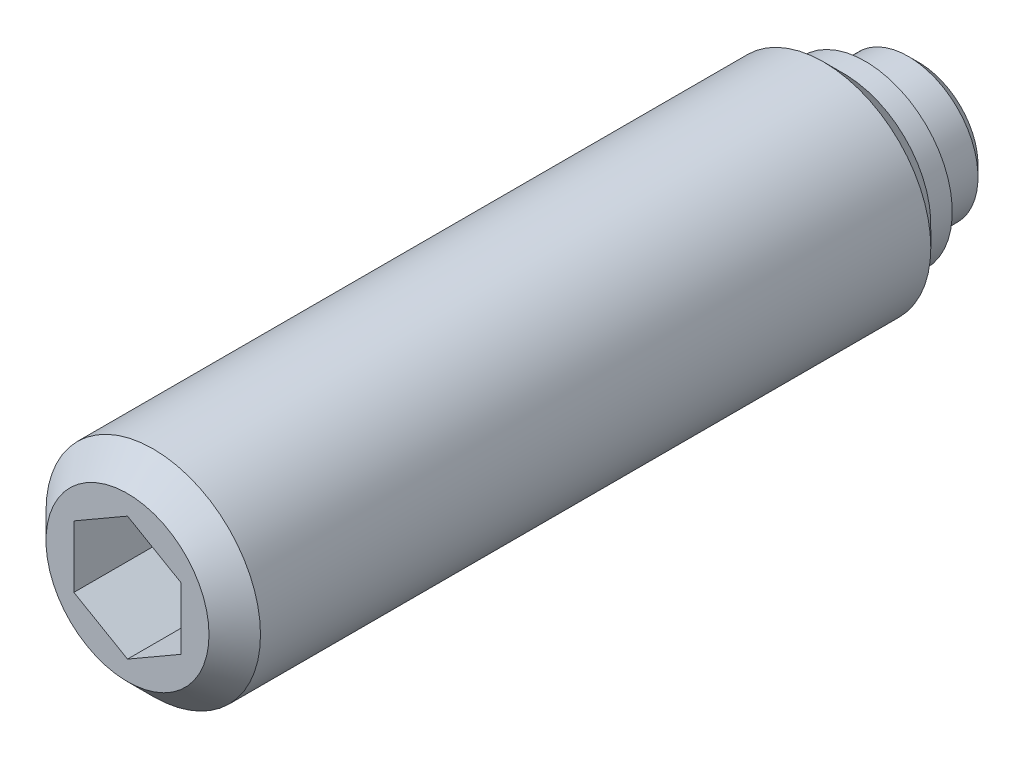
ISO-10303-21;
HEADER;
FILE_DESCRIPTION(('STEP AP214'),'2;1');
FILE_NAME('part.step','',(''),(''),'','','');
FILE_SCHEMA(('AUTOMOTIVE_DESIGN { 1 0 10303 214 1 1 1 1 }'));
ENDSEC;
DATA;
#1=APPLICATION_CONTEXT('core data for automotive mechanical design processes');
#2=APPLICATION_PROTOCOL_DEFINITION('international standard','automotive_design',2000,#1);
#3=PRODUCT_CONTEXT('',#1,'mechanical');
#4=PRODUCT('Part','Part','',(#3));
#5=PRODUCT_RELATED_PRODUCT_CATEGORY('part','',(#4));
#6=PRODUCT_DEFINITION_FORMATION('','',#4);
#7=PRODUCT_DEFINITION_CONTEXT('part definition',#1,'design');
#8=PRODUCT_DEFINITION('design','',#6,#7);
#9=PRODUCT_DEFINITION_SHAPE('','',#8);
#10=(LENGTH_UNIT() NAMED_UNIT(*) SI_UNIT(.MILLI.,.METRE.));
#11=(NAMED_UNIT(*) PLANE_ANGLE_UNIT() SI_UNIT($,.RADIAN.));
#12=(NAMED_UNIT(*) SI_UNIT($,.STERADIAN.) SOLID_ANGLE_UNIT());
#13=UNCERTAINTY_MEASURE_WITH_UNIT(LENGTH_MEASURE(1.E-05),#10,'distance_accuracy_value','');
#14=(GEOMETRIC_REPRESENTATION_CONTEXT(3) GLOBAL_UNCERTAINTY_ASSIGNED_CONTEXT((#13)) GLOBAL_UNIT_ASSIGNED_CONTEXT((#10,
#11,#12)) REPRESENTATION_CONTEXT('',''));
#15=CARTESIAN_POINT('',(0.,0.,0.));
#16=DIRECTION('',(0.,0.,1.));
#17=DIRECTION('',(1.,0.,0.));
#18=AXIS2_PLACEMENT_3D('',#15,#16,#17);
#19=CARTESIAN_POINT('',(0.,0.,2.5));
#20=DIRECTION('',(0.,0.,-1.));
#21=DIRECTION('',(-1.,0.,0.));
#22=AXIS2_PLACEMENT_3D('',#19,#20,#21);
#23=CYLINDRICAL_SURFACE('',#22,5.);
#24=CARTESIAN_POINT('',(0.,0.,35.7));
#25=DIRECTION('',(0.,0.,1.));
#26=DIRECTION('',(1.,0.,0.));
#27=AXIS2_PLACEMENT_3D('',#24,#25,#26);
#28=CIRCLE('',#27,5.);
#29=CARTESIAN_POINT('',(5.,0.,35.7));
#30=VERTEX_POINT('',#29);
#31=EDGE_CURVE('E9',#30,#30,#28,.F.);
#32=ORIENTED_EDGE('',*,*,#31,.T.);
#33=EDGE_LOOP('',(#32));
#34=FACE_BOUND('',#33,.T.);
#35=CARTESIAN_POINT('',(0.,0.,4.45));
#36=DIRECTION('',(0.,0.,-1.));
#37=DIRECTION('',(-1.,0.,0.));
#38=AXIS2_PLACEMENT_3D('',#35,#36,#37);
#39=CIRCLE('',#38,5.);
#40=CARTESIAN_POINT('',(-5.,0.,4.45));
#41=VERTEX_POINT('',#40);
#42=EDGE_CURVE('E74',#41,#41,#39,.T.);
#43=ORIENTED_EDGE('',*,*,#42,.F.);
#44=EDGE_LOOP('',(#43));
#45=FACE_BOUND('',#44,.T.);
#46=ADVANCED_FACE('F14',(#34,#45),#23,.T.);
#47=CARTESIAN_POINT('',(0.,0.,0.));
#48=DIRECTION('',(0.,0.,-1.));
#49=DIRECTION('',(-1.,0.,0.));
#50=AXIS2_PLACEMENT_3D('',#47,#48,#49);
#51=CYLINDRICAL_SURFACE('',#50,3.25);
#52=CARTESIAN_POINT('',(0.,0.,0.5));
#53=DIRECTION('',(0.,0.,-1.));
#54=DIRECTION('',(-1.,0.,0.));
#55=AXIS2_PLACEMENT_3D('',#52,#53,#54);
#56=CIRCLE('',#55,3.25);
#57=CARTESIAN_POINT('',(-3.25,0.,0.5));
#58=VERTEX_POINT('',#57);
#59=EDGE_CURVE('E106',#58,#58,#56,.T.);
#60=ORIENTED_EDGE('',*,*,#59,.F.);
#61=EDGE_LOOP('',(#60));
#62=FACE_BOUND('',#61,.T.);
#63=CARTESIAN_POINT('',(0.,0.,2.5));
#64=DIRECTION('',(0.,0.,-1.));
#65=DIRECTION('',(-1.,0.,0.));
#66=AXIS2_PLACEMENT_3D('',#63,#64,#65);
#67=CIRCLE('',#66,3.25);
#68=CARTESIAN_POINT('',(-3.25,0.,2.5));
#69=VERTEX_POINT('',#68);
#70=EDGE_CURVE('E100',#69,#69,#67,.T.);
#71=ORIENTED_EDGE('',*,*,#70,.T.);
#72=EDGE_LOOP('',(#71));
#73=FACE_BOUND('',#72,.T.);
#74=ADVANCED_FACE('F130',(#62,#73),#51,.T.);
#75=CARTESIAN_POINT('',(0.,0.,0.5));
#76=DIRECTION('',(0.,0.,1.));
#77=DIRECTION('',(1.,0.,0.));
#78=AXIS2_PLACEMENT_3D('',#75,#76,#77);
#79=CONICAL_SURFACE('',#78,3.25,0.785398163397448);
#80=CARTESIAN_POINT('',(0.,0.,0.));
#81=DIRECTION('',(0.,0.,-1.));
#82=DIRECTION('',(-1.,0.,0.));
#83=AXIS2_PLACEMENT_3D('',#80,#81,#82);
#84=CIRCLE('',#83,2.75);
#85=CARTESIAN_POINT('',(-2.75,0.,0.));
#86=VERTEX_POINT('',#85);
#87=EDGE_CURVE('E103',#86,#86,#84,.T.);
#88=ORIENTED_EDGE('',*,*,#87,.F.);
#89=EDGE_LOOP('',(#88));
#90=FACE_BOUND('',#89,.T.);
#91=ORIENTED_EDGE('',*,*,#59,.T.);
#92=EDGE_LOOP('',(#91));
#93=FACE_BOUND('',#92,.T.);
#94=ADVANCED_FACE('F135',(#90,#93),#79,.T.);
#95=CARTESIAN_POINT('',(0.,2.75,0.));
#96=DIRECTION('',(0.,0.,1.));
#97=DIRECTION('',(1.,0.,0.));
#98=AXIS2_PLACEMENT_3D('',#95,#96,#97);
#99=PLANE('',#98);
#100=ORIENTED_EDGE('',*,*,#87,.T.);
#101=EDGE_LOOP('',(#100));
#102=FACE_BOUND('',#101,.T.);
#103=ADVANCED_FACE('F150',(#102),#99,.F.);
#104=CARTESIAN_POINT('',(0.,4.05,2.5));
#105=DIRECTION('',(0.,0.,1.));
#106=DIRECTION('',(1.,0.,0.));
#107=AXIS2_PLACEMENT_3D('',#104,#105,#106);
#108=PLANE('',#107);
#109=CARTESIAN_POINT('',(0.,0.,2.5));
#110=DIRECTION('',(0.,0.,-1.));
#111=DIRECTION('',(-1.,0.,0.));
#112=AXIS2_PLACEMENT_3D('',#109,#110,#111);
#113=CIRCLE('',#112,4.05);
#114=CARTESIAN_POINT('',(-4.05,0.,2.5));
#115=VERTEX_POINT('',#114);
#116=EDGE_CURVE('E109',#115,#115,#113,.T.);
#117=ORIENTED_EDGE('',*,*,#116,.T.);
#118=EDGE_LOOP('',(#117));
#119=FACE_BOUND('',#118,.T.);
#120=ORIENTED_EDGE('',*,*,#70,.F.);
#121=EDGE_LOOP('',(#120));
#122=FACE_BOUND('',#121,.T.);
#123=ADVANCED_FACE('F147',(#119,#122),#108,.F.);
#124=CARTESIAN_POINT('',(0.,0.,2.5));
#125=DIRECTION('',(0.,0.,-1.));
#126=DIRECTION('',(-1.,0.,0.));
#127=AXIS2_PLACEMENT_3D('',#124,#125,#126);
#128=CYLINDRICAL_SURFACE('',#127,4.05);
#129=CARTESIAN_POINT('',(0.,0.,3.5));
#130=DIRECTION('',(0.,0.,-1.));
#131=DIRECTION('',(-1.,0.,0.));
#132=AXIS2_PLACEMENT_3D('',#129,#130,#131);
#133=CIRCLE('',#132,4.05);
#134=CARTESIAN_POINT('',(-4.05,0.,3.5));
#135=VERTEX_POINT('',#134);
#136=EDGE_CURVE('E112',#135,#135,#133,.T.);
#137=ORIENTED_EDGE('',*,*,#136,.T.);
#138=EDGE_LOOP('',(#137));
#139=FACE_BOUND('',#138,.T.);
#140=ORIENTED_EDGE('',*,*,#116,.F.);
#141=EDGE_LOOP('',(#140));
#142=FACE_BOUND('',#141,.T.);
#143=ADVANCED_FACE('F143',(#139,#142),#128,.T.);
#144=CARTESIAN_POINT('',(0.,0.,4.45));
#145=DIRECTION('',(0.,0.,1.));
#146=DIRECTION('',(1.,0.,0.));
#147=AXIS2_PLACEMENT_3D('',#144,#145,#146);
#148=CONICAL_SURFACE('',#147,5.,0.785398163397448);
#149=ORIENTED_EDGE('',*,*,#42,.T.);
#150=EDGE_LOOP('',(#149));
#151=FACE_BOUND('',#150,.T.);
#152=ORIENTED_EDGE('',*,*,#136,.F.);
#153=EDGE_LOOP('',(#152));
#154=FACE_BOUND('',#153,.T.);
#155=ADVANCED_FACE('F140',(#151,#154),#148,.T.);
#156=CARTESIAN_POINT('',(0.,0.,36.9));
#157=DIRECTION('',(0.,0.,1.));
#158=DIRECTION('',(1.,0.,0.));
#159=AXIS2_PLACEMENT_3D('',#156,#157,#158);
#160=PLANE('',#159);
#161=CARTESIAN_POINT('',(0.,0.,36.9));
#162=DIRECTION('',(0.,0.,1.));
#163=DIRECTION('',(1.,0.,0.));
#164=AXIS2_PLACEMENT_3D('',#161,#162,#163);
#165=CIRCLE('',#164,3.8);
#166=CARTESIAN_POINT('',(3.8,0.,36.9));
#167=VERTEX_POINT('',#166);
#168=EDGE_CURVE('E22',#167,#167,#165,.T.);
#169=ORIENTED_EDGE('',*,*,#168,.T.);
#170=EDGE_LOOP('',(#169));
#171=FACE_BOUND('',#170,.T.);
#172=DIRECTION('',(-0.866025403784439,0.5,0.));
#173=VECTOR('',#172,1.);
#174=CARTESIAN_POINT('',(-2.5,-1.44337567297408,36.9));
#175=LINE('',#174,#173);
#176=CARTESIAN_POINT('',(0.,-2.88675134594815,36.9));
#177=VERTEX_POINT('',#176);
#178=CARTESIAN_POINT('',(-2.5,-1.44337567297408,36.9));
#179=VERTEX_POINT('',#178);
#180=EDGE_CURVE('E69',#177,#179,#175,.T.);
#181=ORIENTED_EDGE('',*,*,#180,.T.);
#182=DIRECTION('',(0.,1.,0.));
#183=VECTOR('',#182,1.);
#184=CARTESIAN_POINT('',(-2.5,1.44337567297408,36.9));
#185=LINE('',#184,#183);
#186=CARTESIAN_POINT('',(-2.5,1.44337567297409,36.9));
#187=VERTEX_POINT('',#186);
#188=EDGE_CURVE('E84',#179,#187,#185,.T.);
#189=ORIENTED_EDGE('',*,*,#188,.T.);
#190=DIRECTION('',(0.866025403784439,0.5,0.));
#191=VECTOR('',#190,1.);
#192=CARTESIAN_POINT('',(0.,2.88675134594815,36.9));
#193=LINE('',#192,#191);
#194=CARTESIAN_POINT('',(0.,2.88675134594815,36.9));
#195=VERTEX_POINT('',#194);
#196=EDGE_CURVE('E301',#187,#195,#193,.T.);
#197=ORIENTED_EDGE('',*,*,#196,.T.);
#198=DIRECTION('',(0.866025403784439,-0.5,0.));
#199=VECTOR('',#198,1.);
#200=CARTESIAN_POINT('',(2.5,1.44337567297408,36.9));
#201=LINE('',#200,#199);
#202=CARTESIAN_POINT('',(2.5,1.44337567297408,36.9));
#203=VERTEX_POINT('',#202);
#204=EDGE_CURVE('E298',#195,#203,#201,.T.);
#205=ORIENTED_EDGE('',*,*,#204,.T.);
#206=DIRECTION('',(0.,-1.,0.));
#207=VECTOR('',#206,1.);
#208=CARTESIAN_POINT('',(2.5,-1.44337567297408,36.9));
#209=LINE('',#208,#207);
#210=CARTESIAN_POINT('',(2.5,-1.44337567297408,36.9));
#211=VERTEX_POINT('',#210);
#212=EDGE_CURVE('E29',#203,#211,#209,.T.);
#213=ORIENTED_EDGE('',*,*,#212,.T.);
#214=DIRECTION('',(-0.866025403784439,-0.5,0.));
#215=VECTOR('',#214,1.);
#216=CARTESIAN_POINT('',(0.,-2.88675134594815,36.9));
#217=LINE('',#216,#215);
#218=EDGE_CURVE('E66',#211,#177,#217,.T.);
#219=ORIENTED_EDGE('',*,*,#218,.T.);
#220=EDGE_LOOP('',(#181,#189,#197,#205,#213,#219));
#221=FACE_BOUND('',#220,.T.);
#222=ADVANCED_FACE('F68',(#171,#221),#160,.T.);
#223=CARTESIAN_POINT('',(0.,0.,30.9));
#224=DIRECTION('',(0.,0.,1.));
#225=DIRECTION('',(1.,0.,0.));
#226=AXIS2_PLACEMENT_3D('',#223,#224,#225);
#227=PLANE('',#226);
#228=DIRECTION('',(0.,-1.,0.));
#229=VECTOR('',#228,1.);
#230=CARTESIAN_POINT('',(-2.5,1.44337567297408,30.9));
#231=LINE('',#230,#229);
#232=CARTESIAN_POINT('',(-2.5,1.44337567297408,30.9));
#233=VERTEX_POINT('',#232);
#234=CARTESIAN_POINT('',(-2.5,-1.44337567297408,30.9));
#235=VERTEX_POINT('',#234);
#236=EDGE_CURVE('E83',#233,#235,#231,.T.);
#237=ORIENTED_EDGE('',*,*,#236,.T.);
#238=DIRECTION('',(0.866025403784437,-0.5,0.));
#239=VECTOR('',#238,1.);
#240=CARTESIAN_POINT('',(-2.5,-1.44337567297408,30.9));
#241=LINE('',#240,#239);
#242=CARTESIAN_POINT('',(0.,-2.88675134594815,30.9));
#243=VERTEX_POINT('',#242);
#244=EDGE_CURVE('E280',#235,#243,#241,.T.);
#245=ORIENTED_EDGE('',*,*,#244,.T.);
#246=DIRECTION('',(0.866025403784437,0.5,0.));
#247=VECTOR('',#246,1.);
#248=CARTESIAN_POINT('',(0.,-2.88675134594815,30.9));
#249=LINE('',#248,#247);
#250=CARTESIAN_POINT('',(2.5,-1.44337567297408,30.9));
#251=VERTEX_POINT('',#250);
#252=EDGE_CURVE('E88',#243,#251,#249,.T.);
#253=ORIENTED_EDGE('',*,*,#252,.T.);
#254=DIRECTION('',(0.,1.,0.));
#255=VECTOR('',#254,1.);
#256=CARTESIAN_POINT('',(2.5,-1.44337567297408,30.9));
#257=LINE('',#256,#255);
#258=CARTESIAN_POINT('',(2.5,1.44337567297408,30.9));
#259=VERTEX_POINT('',#258);
#260=EDGE_CURVE('E287',#251,#259,#257,.T.);
#261=ORIENTED_EDGE('',*,*,#260,.T.);
#262=DIRECTION('',(-0.866025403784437,0.5,0.));
#263=VECTOR('',#262,1.);
#264=CARTESIAN_POINT('',(2.5,1.44337567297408,30.9));
#265=LINE('',#264,#263);
#266=CARTESIAN_POINT('',(0.,2.88675134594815,30.9));
#267=VERTEX_POINT('',#266);
#268=EDGE_CURVE('E96',#259,#267,#265,.T.);
#269=ORIENTED_EDGE('',*,*,#268,.T.);
#270=DIRECTION('',(-0.866025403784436,-0.5,0.));
#271=VECTOR('',#270,1.);
#272=CARTESIAN_POINT('',(0.,2.88675134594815,30.9));
#273=LINE('',#272,#271);
#274=EDGE_CURVE('E91',#267,#233,#273,.T.);
#275=ORIENTED_EDGE('',*,*,#274,.T.);
#276=EDGE_LOOP('',(#237,#245,#253,#261,#269,#275));
#277=FACE_BOUND('',#276,.T.);
#278=ADVANCED_FACE('F162',(#277),#227,.T.);
#279=CARTESIAN_POINT('',(0.,-2.88675134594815,35.9));
#280=DIRECTION('',(0.5,-0.866025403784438,0.));
#281=DIRECTION('',(0.866025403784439,0.5,0.));
#282=AXIS2_PLACEMENT_3D('',#279,#280,#281);
#283=PLANE('',#282);
#284=ORIENTED_EDGE('',*,*,#218,.F.);
#285=DIRECTION('',(0.,0.,1.));
#286=VECTOR('',#285,1.);
#287=CARTESIAN_POINT('',(2.5,-1.44337567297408,35.9));
#288=LINE('',#287,#286);
#289=EDGE_CURVE('E90',#251,#211,#288,.T.);
#290=ORIENTED_EDGE('',*,*,#289,.F.);
#291=ORIENTED_EDGE('',*,*,#252,.F.);
#292=DIRECTION('',(0.,0.,1.));
#293=VECTOR('',#292,1.);
#294=CARTESIAN_POINT('',(0.,-2.88675134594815,35.9));
#295=LINE('',#294,#293);
#296=EDGE_CURVE('E80',#243,#177,#295,.T.);
#297=ORIENTED_EDGE('',*,*,#296,.T.);
#298=EDGE_LOOP('',(#284,#290,#291,#297));
#299=FACE_BOUND('',#298,.T.);
#300=ADVANCED_FACE('F86',(#299),#283,.F.);
#301=CARTESIAN_POINT('',(2.5,-1.44337567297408,35.9));
#302=DIRECTION('',(1.,0.,0.));
#303=DIRECTION('',(0.,1.,0.));
#304=AXIS2_PLACEMENT_3D('',#301,#302,#303);
#305=PLANE('',#304);
#306=ORIENTED_EDGE('',*,*,#212,.F.);
#307=DIRECTION('',(0.,0.,1.));
#308=VECTOR('',#307,1.);
#309=CARTESIAN_POINT('',(2.5,1.44337567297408,35.9));
#310=LINE('',#309,#308);
#311=EDGE_CURVE('E93',#259,#203,#310,.T.);
#312=ORIENTED_EDGE('',*,*,#311,.F.);
#313=ORIENTED_EDGE('',*,*,#260,.F.);
#314=ORIENTED_EDGE('',*,*,#289,.T.);
#315=EDGE_LOOP('',(#306,#312,#313,#314));
#316=FACE_BOUND('',#315,.T.);
#317=ADVANCED_FACE('F161',(#316),#305,.F.);
#318=CARTESIAN_POINT('',(2.5,1.44337567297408,35.9));
#319=DIRECTION('',(0.5,0.866025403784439,0.));
#320=DIRECTION('',(-0.866025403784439,0.5,0.));
#321=AXIS2_PLACEMENT_3D('',#318,#319,#320);
#322=PLANE('',#321);
#323=ORIENTED_EDGE('',*,*,#204,.F.);
#324=DIRECTION('',(0.,0.,1.));
#325=VECTOR('',#324,1.);
#326=CARTESIAN_POINT('',(0.,2.88675134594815,35.9));
#327=LINE('',#326,#325);
#328=EDGE_CURVE('E293',#267,#195,#327,.T.);
#329=ORIENTED_EDGE('',*,*,#328,.F.);
#330=ORIENTED_EDGE('',*,*,#268,.F.);
#331=ORIENTED_EDGE('',*,*,#311,.T.);
#332=EDGE_LOOP('',(#323,#329,#330,#331));
#333=FACE_BOUND('',#332,.T.);
#334=ADVANCED_FACE('F165',(#333),#322,.F.);
#335=CARTESIAN_POINT('',(0.,2.88675134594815,35.9));
#336=DIRECTION('',(-0.5,0.866025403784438,0.));
#337=DIRECTION('',(-0.866025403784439,-0.5,0.));
#338=AXIS2_PLACEMENT_3D('',#335,#336,#337);
#339=PLANE('',#338);
#340=ORIENTED_EDGE('',*,*,#196,.F.);
#341=DIRECTION('',(0.,0.,1.));
#342=VECTOR('',#341,1.);
#343=CARTESIAN_POINT('',(-2.5,1.44337567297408,35.9));
#344=LINE('',#343,#342);
#345=EDGE_CURVE('E37',#233,#187,#344,.T.);
#346=ORIENTED_EDGE('',*,*,#345,.F.);
#347=ORIENTED_EDGE('',*,*,#274,.F.);
#348=ORIENTED_EDGE('',*,*,#328,.T.);
#349=EDGE_LOOP('',(#340,#346,#347,#348));
#350=FACE_BOUND('',#349,.T.);
#351=ADVANCED_FACE('F169',(#350),#339,.F.);
#352=CARTESIAN_POINT('',(-2.5,1.44337567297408,35.9));
#353=DIRECTION('',(-1.,0.,0.));
#354=DIRECTION('',(0.,0.,1.));
#355=AXIS2_PLACEMENT_3D('',#352,#353,#354);
#356=PLANE('',#355);
#357=ORIENTED_EDGE('',*,*,#188,.F.);
#358=DIRECTION('',(0.,0.,1.));
#359=VECTOR('',#358,1.);
#360=CARTESIAN_POINT('',(-2.5,-1.44337567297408,35.9));
#361=LINE('',#360,#359);
#362=EDGE_CURVE('E82',#235,#179,#361,.T.);
#363=ORIENTED_EDGE('',*,*,#362,.F.);
#364=ORIENTED_EDGE('',*,*,#236,.F.);
#365=ORIENTED_EDGE('',*,*,#345,.T.);
#366=EDGE_LOOP('',(#357,#363,#364,#365));
#367=FACE_BOUND('',#366,.T.);
#368=ADVANCED_FACE('F126',(#367),#356,.F.);
#369=CARTESIAN_POINT('',(-2.5,-1.44337567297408,35.9));
#370=DIRECTION('',(-0.5,-0.866025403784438,0.));
#371=DIRECTION('',(0.866025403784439,-0.5,0.));
#372=AXIS2_PLACEMENT_3D('',#369,#370,#371);
#373=PLANE('',#372);
#374=ORIENTED_EDGE('',*,*,#180,.F.);
#375=ORIENTED_EDGE('',*,*,#296,.F.);
#376=ORIENTED_EDGE('',*,*,#244,.F.);
#377=ORIENTED_EDGE('',*,*,#362,.T.);
#378=EDGE_LOOP('',(#374,#375,#376,#377));
#379=FACE_BOUND('',#378,.T.);
#380=ADVANCED_FACE('F78',(#379),#373,.F.);
#381=CARTESIAN_POINT('',(0.,0.,36.9));
#382=DIRECTION('',(0.,0.,-1.));
#383=DIRECTION('',(-1.,0.,0.));
#384=AXIS2_PLACEMENT_3D('',#381,#382,#383);
#385=CONICAL_SURFACE('',#384,3.8,0.785398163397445);
#386=ORIENTED_EDGE('',*,*,#31,.F.);
#387=EDGE_LOOP('',(#386));
#388=FACE_BOUND('',#387,.T.);
#389=ORIENTED_EDGE('',*,*,#168,.F.);
#390=EDGE_LOOP('',(#389));
#391=FACE_BOUND('',#390,.T.);
#392=ADVANCED_FACE('F16',(#388,#391),#385,.T.);
#393=CLOSED_SHELL('',(#46,#74,#94,#103,#123,#143,#155,#222,#278,#300,#317,#334,#351,#368,#380,#392));
#394=MANIFOLD_SOLID_BREP('B1',#393);
#395=ADVANCED_BREP_SHAPE_REPRESENTATION('',(#18,#394),#14);
#396=SHAPE_DEFINITION_REPRESENTATION(#9,#395);
ENDSEC;
END-ISO-10303-21;
